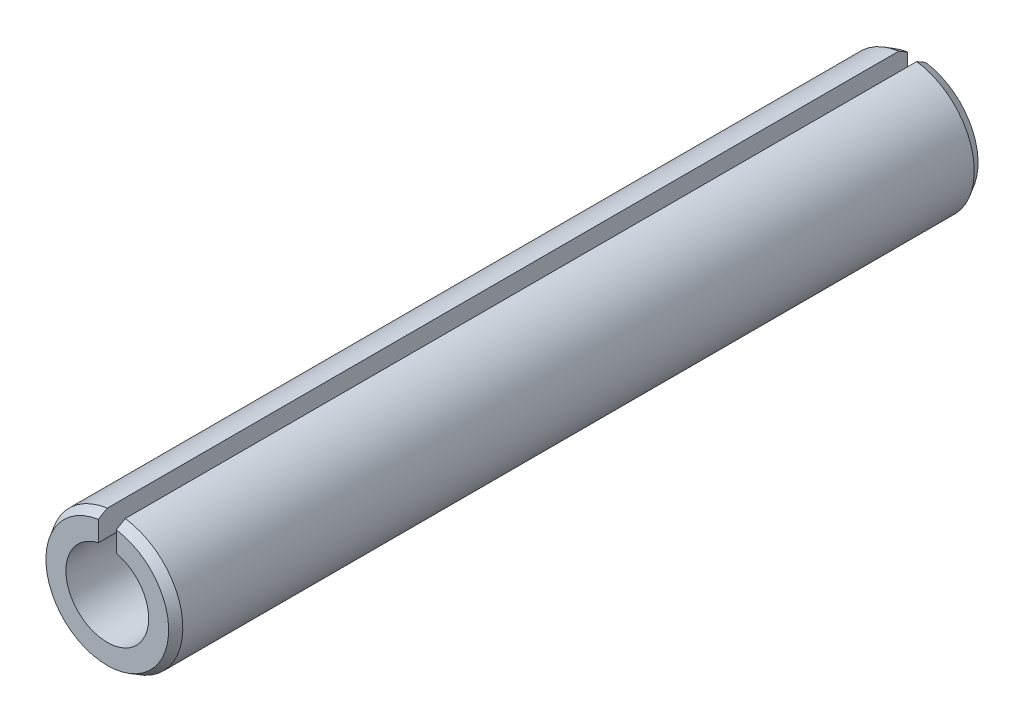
ISO-10303-21;
HEADER;
FILE_DESCRIPTION(('STEP AP214'),'2;1');
FILE_NAME('part.step','',(''),(''),'','','');
FILE_SCHEMA(('AUTOMOTIVE_DESIGN { 1 0 10303 214 1 1 1 1 }'));
ENDSEC;
DATA;
#1=APPLICATION_CONTEXT('core data for automotive mechanical design processes');
#2=APPLICATION_PROTOCOL_DEFINITION('international standard','automotive_design',2000,#1);
#3=PRODUCT_CONTEXT('',#1,'mechanical');
#4=PRODUCT('Part','Part','',(#3));
#5=PRODUCT_RELATED_PRODUCT_CATEGORY('part','',(#4));
#6=PRODUCT_DEFINITION_FORMATION('','',#4);
#7=PRODUCT_DEFINITION_CONTEXT('part definition',#1,'design');
#8=PRODUCT_DEFINITION('design','',#6,#7);
#9=PRODUCT_DEFINITION_SHAPE('','',#8);
#10=(LENGTH_UNIT() NAMED_UNIT(*) SI_UNIT(.MILLI.,.METRE.));
#11=(NAMED_UNIT(*) PLANE_ANGLE_UNIT() SI_UNIT($,.RADIAN.));
#12=(NAMED_UNIT(*) SI_UNIT($,.STERADIAN.) SOLID_ANGLE_UNIT());
#13=UNCERTAINTY_MEASURE_WITH_UNIT(LENGTH_MEASURE(1.E-05),#10,'distance_accuracy_value','');
#14=(GEOMETRIC_REPRESENTATION_CONTEXT(3) GLOBAL_UNCERTAINTY_ASSIGNED_CONTEXT((#13)) GLOBAL_UNIT_ASSIGNED_CONTEXT((#10,
#11,#12)) REPRESENTATION_CONTEXT('',''));
#15=CARTESIAN_POINT('',(0.,0.,0.));
#16=DIRECTION('',(0.,0.,1.));
#17=DIRECTION('',(1.,0.,0.));
#18=AXIS2_PLACEMENT_3D('',#15,#16,#17);
#19=CARTESIAN_POINT('',(0.,0.,45.));
#20=DIRECTION('',(0.,0.,-1.));
#21=DIRECTION('',(-1.,0.,0.));
#22=AXIS2_PLACEMENT_3D('',#19,#20,#21);
#23=CYLINDRICAL_SURFACE('',#22,2.3);
#24=CARTESIAN_POINT('',(0.,0.,0.));
#25=DIRECTION('',(0.,0.,-1.));
#26=DIRECTION('',(1.,0.,0.));
#27=AXIS2_PLACEMENT_3D('',#24,#25,#26);
#28=CIRCLE('',#27,2.3);
#29=CARTESIAN_POINT('',(0.499999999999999,2.24499443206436,0.));
#30=VERTEX_POINT('',#29);
#31=CARTESIAN_POINT('',(-0.5,2.24499443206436,0.));
#32=VERTEX_POINT('',#31);
#33=EDGE_CURVE('E88',#30,#32,#28,.T.);
#34=ORIENTED_EDGE('',*,*,#33,.T.);
#35=DIRECTION('',(0.,0.,-1.));
#36=VECTOR('',#35,1.);
#37=CARTESIAN_POINT('',(-0.5,2.24499443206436,45.));
#38=LINE('',#37,#36);
#39=CARTESIAN_POINT('',(-0.5,2.24499443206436,45.));
#40=VERTEX_POINT('',#39);
#41=EDGE_CURVE('E93',#40,#32,#38,.T.);
#42=ORIENTED_EDGE('',*,*,#41,.F.);
#43=CARTESIAN_POINT('',(0.,0.,45.));
#44=DIRECTION('',(0.,0.,-1.));
#45=DIRECTION('',(1.,0.,0.));
#46=AXIS2_PLACEMENT_3D('',#43,#44,#45);
#47=CIRCLE('',#46,2.3);
#48=CARTESIAN_POINT('',(0.499999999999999,2.24499443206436,45.));
#49=VERTEX_POINT('',#48);
#50=EDGE_CURVE('E108',#49,#40,#47,.T.);
#51=ORIENTED_EDGE('',*,*,#50,.F.);
#52=DIRECTION('',(0.,0.,-1.));
#53=VECTOR('',#52,1.);
#54=CARTESIAN_POINT('',(0.499999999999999,2.24499443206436,45.));
#55=LINE('',#54,#53);
#56=EDGE_CURVE('E104',#49,#30,#55,.T.);
#57=ORIENTED_EDGE('',*,*,#56,.T.);
#58=EDGE_LOOP('',(#34,#42,#51,#57));
#59=FACE_BOUND('',#58,.T.);
#60=ADVANCED_FACE('F32',(#59),#23,.F.);
#61=CARTESIAN_POINT('',(-0.5,3.66606055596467,45.));
#62=DIRECTION('',(-1.,0.,0.));
#63=DIRECTION('',(0.,-1.,0.));
#64=AXIS2_PLACEMENT_3D('',#61,#62,#63);
#65=PLANE('',#64);
#66=DIRECTION('',(0.,1.,0.));
#67=VECTOR('',#66,1.);
#68=CARTESIAN_POINT('',(-0.5,3.66606055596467,0.));
#69=LINE('',#68,#67);
#70=CARTESIAN_POINT('',(-0.5,3.37448326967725,0.));
#71=VERTEX_POINT('',#70);
#72=EDGE_CURVE('E84',#32,#71,#69,.T.);
#73=ORIENTED_EDGE('',*,*,#72,.T.);
#74=CARTESIAN_POINT('',(-0.5,3.37448326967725,0.));
#75=CARTESIAN_POINT('',(-0.5,3.42310923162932,0.0833159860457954));
#76=CARTESIAN_POINT('',(-0.5,3.47172031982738,0.166640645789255));
#77=CARTESIAN_POINT('',(-0.5,3.56891274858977,0.333307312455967));
#78=CARTESIAN_POINT('',(-0.5,3.61749408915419,0.416649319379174));
#79=CARTESIAN_POINT('',(-0.5,3.66606055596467,0.5));
#80=B_SPLINE_CURVE_WITH_KNOTS('',3,(#74,#75,#76,#77,#78,#79),.UNSPECIFIED.,.F.,.F.,(4,2,4),(0.,
0.289403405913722,0.578806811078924),.UNSPECIFIED.);
#81=CARTESIAN_POINT('',(-0.500000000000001,3.66606055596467,0.5));
#82=VERTEX_POINT('',#81);
#83=EDGE_CURVE('E39',#71,#82,#80,.T.);
#84=ORIENTED_EDGE('',*,*,#83,.T.);
#85=DIRECTION('',(0.,0.,-1.));
#86=VECTOR('',#85,1.);
#87=CARTESIAN_POINT('',(-0.500000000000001,3.66606055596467,45.));
#88=LINE('',#87,#86);
#89=CARTESIAN_POINT('',(-0.500000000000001,3.66606055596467,44.5));
#90=VERTEX_POINT('',#89);
#91=EDGE_CURVE('E100',#90,#82,#88,.T.);
#92=ORIENTED_EDGE('',*,*,#91,.F.);
#93=CARTESIAN_POINT('',(-0.500000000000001,3.66606055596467,44.5));
#94=CARTESIAN_POINT('',(-0.500000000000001,3.61749408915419,44.5833506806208));
#95=CARTESIAN_POINT('',(-0.500000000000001,3.56891274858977,44.666692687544));
#96=CARTESIAN_POINT('',(-0.5,3.47172031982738,44.8333593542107));
#97=CARTESIAN_POINT('',(-0.5,3.42310923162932,44.9166840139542));
#98=CARTESIAN_POINT('',(-0.5,3.37448326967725,45.));
#99=B_SPLINE_CURVE_WITH_KNOTS('',3,(#93,#94,#95,#96,#97,#98),.UNSPECIFIED.,.F.,.F.,(4,2,4),(0.,
0.289403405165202,0.578806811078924),.UNSPECIFIED.);
#100=CARTESIAN_POINT('',(-0.5,3.37448326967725,45.));
#101=VERTEX_POINT('',#100);
#102=EDGE_CURVE('E46',#90,#101,#99,.T.);
#103=ORIENTED_EDGE('',*,*,#102,.T.);
#104=DIRECTION('',(0.,1.,0.));
#105=VECTOR('',#104,1.);
#106=CARTESIAN_POINT('',(-0.5,3.66606055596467,45.));
#107=LINE('',#106,#105);
#108=EDGE_CURVE('E95',#40,#101,#107,.T.);
#109=ORIENTED_EDGE('',*,*,#108,.F.);
#110=ORIENTED_EDGE('',*,*,#41,.T.);
#111=EDGE_LOOP('',(#73,#84,#92,#103,#109,#110));
#112=FACE_BOUND('',#111,.T.);
#113=ADVANCED_FACE('F94',(#112),#65,.F.);
#114=CARTESIAN_POINT('',(0.,0.,45.));
#115=DIRECTION('',(0.,0.,-1.));
#116=DIRECTION('',(-1.,0.,0.));
#117=AXIS2_PLACEMENT_3D('',#114,#115,#116);
#118=CYLINDRICAL_SURFACE('',#117,3.7);
#119=ORIENTED_EDGE('',*,*,#91,.T.);
#120=CARTESIAN_POINT('',(0.,0.,0.5));
#121=DIRECTION('',(0.,0.,1.));
#122=DIRECTION('',(1.,0.,0.));
#123=AXIS2_PLACEMENT_3D('',#120,#121,#122);
#124=CIRCLE('',#123,3.7);
#125=CARTESIAN_POINT('',(0.499999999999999,3.66606055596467,0.5));
#126=VERTEX_POINT('',#125);
#127=EDGE_CURVE('E120',#82,#126,#124,.T.);
#128=ORIENTED_EDGE('',*,*,#127,.T.);
#129=DIRECTION('',(0.,0.,-1.));
#130=VECTOR('',#129,1.);
#131=CARTESIAN_POINT('',(0.499999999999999,3.66606055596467,45.));
#132=LINE('',#131,#130);
#133=CARTESIAN_POINT('',(0.499999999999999,3.66606055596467,44.5));
#134=VERTEX_POINT('',#133);
#135=EDGE_CURVE('E114',#134,#126,#132,.T.);
#136=ORIENTED_EDGE('',*,*,#135,.F.);
#137=CARTESIAN_POINT('',(0.,0.,44.5));
#138=DIRECTION('',(0.,0.,1.));
#139=DIRECTION('',(1.,0.,0.));
#140=AXIS2_PLACEMENT_3D('',#137,#138,#139);
#141=CIRCLE('',#140,3.7);
#142=EDGE_CURVE('E99',#134,#90,#141,.F.);
#143=ORIENTED_EDGE('',*,*,#142,.T.);
#144=EDGE_LOOP('',(#119,#128,#136,#143));
#145=FACE_BOUND('',#144,.T.);
#146=ADVANCED_FACE('F144',(#145),#118,.T.);
#147=CARTESIAN_POINT('',(0.499999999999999,3.66606055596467,45.));
#148=DIRECTION('',(1.,0.,0.));
#149=DIRECTION('',(0.,1.,0.));
#150=AXIS2_PLACEMENT_3D('',#147,#148,#149);
#151=PLANE('',#150);
#152=ORIENTED_EDGE('',*,*,#135,.T.);
#153=CARTESIAN_POINT('',(0.499999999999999,3.66606055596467,0.5));
#154=CARTESIAN_POINT('',(0.499999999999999,3.61749408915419,0.416649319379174));
#155=CARTESIAN_POINT('',(0.499999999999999,3.56891274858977,0.333307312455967));
#156=CARTESIAN_POINT('',(0.499999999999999,3.47172031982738,0.166640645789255));
#157=CARTESIAN_POINT('',(0.499999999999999,3.42310923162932,0.0833159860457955));
#158=CARTESIAN_POINT('',(0.499999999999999,3.37448326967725,0.));
#159=B_SPLINE_CURVE_WITH_KNOTS('',3,(#153,#154,#155,#156,#157,#158),.UNSPECIFIED.,.F.,.F.,(4,2,
4),(0.,0.289403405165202,0.578806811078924),.UNSPECIFIED.);
#160=CARTESIAN_POINT('',(0.499999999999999,3.37448326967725,0.));
#161=VERTEX_POINT('',#160);
#162=EDGE_CURVE('E130',#126,#161,#159,.T.);
#163=ORIENTED_EDGE('',*,*,#162,.T.);
#164=DIRECTION('',(0.,-1.,0.));
#165=VECTOR('',#164,1.);
#166=CARTESIAN_POINT('',(0.499999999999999,3.66606055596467,0.));
#167=LINE('',#166,#165);
#168=EDGE_CURVE('E90',#161,#30,#167,.T.);
#169=ORIENTED_EDGE('',*,*,#168,.T.);
#170=ORIENTED_EDGE('',*,*,#56,.F.);
#171=DIRECTION('',(0.,-1.,0.));
#172=VECTOR('',#171,1.);
#173=CARTESIAN_POINT('',(0.499999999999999,3.66606055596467,45.));
#174=LINE('',#173,#172);
#175=CARTESIAN_POINT('',(0.499999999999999,3.37448326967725,45.));
#176=VERTEX_POINT('',#175);
#177=EDGE_CURVE('E111',#176,#49,#174,.T.);
#178=ORIENTED_EDGE('',*,*,#177,.F.);
#179=CARTESIAN_POINT('',(0.5,3.37448326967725,45.));
#180=CARTESIAN_POINT('',(0.499999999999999,3.42310923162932,44.9166840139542));
#181=CARTESIAN_POINT('',(0.499999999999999,3.47172031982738,44.8333593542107));
#182=CARTESIAN_POINT('',(0.499999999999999,3.56891274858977,44.666692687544));
#183=CARTESIAN_POINT('',(0.499999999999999,3.61749408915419,44.5833506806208));
#184=CARTESIAN_POINT('',(0.499999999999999,3.66606055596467,44.5));
#185=B_SPLINE_CURVE_WITH_KNOTS('',3,(#179,#180,#181,#182,#183,#184),.UNSPECIFIED.,.F.,.F.,(4,2,
4),(0.,0.289403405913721,0.578806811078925),.UNSPECIFIED.);
#186=EDGE_CURVE('E123',#176,#134,#185,.T.);
#187=ORIENTED_EDGE('',*,*,#186,.T.);
#188=EDGE_LOOP('',(#152,#163,#169,#170,#178,#187));
#189=FACE_BOUND('',#188,.T.);
#190=ADVANCED_FACE('F138',(#189),#151,.F.);
#191=CARTESIAN_POINT('',(0.,0.,45.));
#192=DIRECTION('',(0.,0.,1.));
#193=DIRECTION('',(1.,0.,0.));
#194=AXIS2_PLACEMENT_3D('',#191,#192,#193);
#195=PLANE('',#194);
#196=ORIENTED_EDGE('',*,*,#108,.T.);
#197=CARTESIAN_POINT('',(0.,0.,45.));
#198=DIRECTION('',(0.,0.,1.));
#199=DIRECTION('',(1.,0.,0.));
#200=AXIS2_PLACEMENT_3D('',#197,#198,#199);
#201=CIRCLE('',#200,3.41132486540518);
#202=EDGE_CURVE('E11',#101,#176,#201,.T.);
#203=ORIENTED_EDGE('',*,*,#202,.T.);
#204=ORIENTED_EDGE('',*,*,#177,.T.);
#205=ORIENTED_EDGE('',*,*,#50,.T.);
#206=EDGE_LOOP('',(#196,#203,#204,#205));
#207=FACE_BOUND('',#206,.T.);
#208=ADVANCED_FACE('F143',(#207),#195,.T.);
#209=CARTESIAN_POINT('',(0.,0.,0.));
#210=DIRECTION('',(0.,0.,1.));
#211=DIRECTION('',(1.,0.,0.));
#212=AXIS2_PLACEMENT_3D('',#209,#210,#211);
#213=PLANE('',#212);
#214=ORIENTED_EDGE('',*,*,#168,.F.);
#215=CARTESIAN_POINT('',(0.,0.,0.));
#216=DIRECTION('',(0.,0.,1.));
#217=DIRECTION('',(1.,0.,0.));
#218=AXIS2_PLACEMENT_3D('',#215,#216,#217);
#219=CIRCLE('',#218,3.41132486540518);
#220=EDGE_CURVE('E54',#161,#71,#219,.F.);
#221=ORIENTED_EDGE('',*,*,#220,.T.);
#222=ORIENTED_EDGE('',*,*,#72,.F.);
#223=ORIENTED_EDGE('',*,*,#33,.F.);
#224=EDGE_LOOP('',(#214,#221,#222,#223));
#225=FACE_BOUND('',#224,.T.);
#226=ADVANCED_FACE('F86',(#225),#213,.F.);
#227=CARTESIAN_POINT('',(0.,0.,0.5));
#228=DIRECTION('',(0.,0.,1.));
#229=DIRECTION('',(1.,0.,0.));
#230=AXIS2_PLACEMENT_3D('',#227,#228,#229);
#231=CONICAL_SURFACE('',#230,3.7,0.523598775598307);
#232=ORIENTED_EDGE('',*,*,#83,.F.);
#233=ORIENTED_EDGE('',*,*,#220,.F.);
#234=ORIENTED_EDGE('',*,*,#162,.F.);
#235=ORIENTED_EDGE('',*,*,#127,.F.);
#236=EDGE_LOOP('',(#232,#233,#234,#235));
#237=FACE_BOUND('',#236,.T.);
#238=ADVANCED_FACE('F160',(#237),#231,.T.);
#239=CARTESIAN_POINT('',(0.,0.,45.));
#240=DIRECTION('',(0.,0.,-1.));
#241=DIRECTION('',(-1.,0.,0.));
#242=AXIS2_PLACEMENT_3D('',#239,#240,#241);
#243=CONICAL_SURFACE('',#242,3.41132486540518,0.523598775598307);
#244=ORIENTED_EDGE('',*,*,#102,.F.);
#245=ORIENTED_EDGE('',*,*,#142,.F.);
#246=ORIENTED_EDGE('',*,*,#186,.F.);
#247=ORIENTED_EDGE('',*,*,#202,.F.);
#248=EDGE_LOOP('',(#244,#245,#246,#247));
#249=FACE_BOUND('',#248,.T.);
#250=ADVANCED_FACE('F136',(#249),#243,.T.);
#251=CLOSED_SHELL('',(#60,#113,#146,#190,#208,#226,#238,#250));
#252=MANIFOLD_SOLID_BREP('B2',#251);
#253=ADVANCED_BREP_SHAPE_REPRESENTATION('',(#18,#252),#14);
#254=SHAPE_DEFINITION_REPRESENTATION(#9,#253);
ENDSEC;
END-ISO-10303-21;
